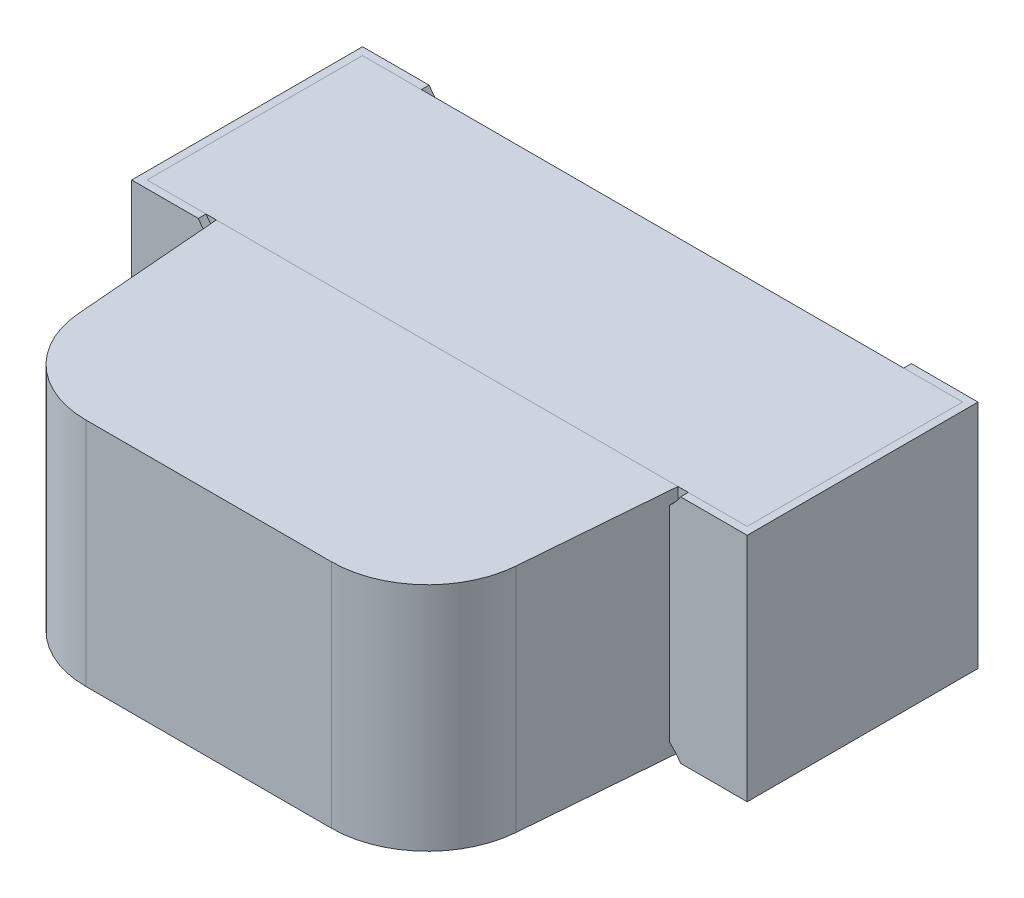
from build123d import *

# Parameters (mm, degrees)
SKETCH1_W        = 1.56
SKETCH1_H        = 0.56
EXTRUDE1_DEPTH   = 0.6
EXTRUDE2_DEPTH   = 0.6
EXTRUDE2_2_DEPTH = 0.6
SKETCH4_R        = 0.15
EXTRUDE4_DEPTH   = 2.166190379
EXTRUDE3_DEPTH   = 0.6
SKETCH5_W        = 0.3
SKETCH5_H        = 0.5
EXTRUDE5_DEPTH   = 0.01


with BuildPart() as part:
    # Sketch1 → Extrude1 (new body)
    with BuildSketch(Plane(origin=(0, 0, 0), x_dir=(1, 0, 0), z_dir=(0, 1, 0))):
        Rectangle(SKETCH1_W, SKETCH1_H)
    extrude(amount=EXTRUDE1_DEPTH)

    # Sketch5 → Extrude5 (cut)
    with BuildSketch(Plane(origin=(0, 0, -0.28), x_dir=(-1, 0, 0), z_dir=(0, 0, -1))):
        with Locations((-0.25, 0.3)):
            Rectangle(SKETCH5_W, SKETCH5_H)
    extrude(amount=-EXTRUDE5_DEPTH, mode=Mode.SUBTRACT)


with BuildPart() as body_2:
    # Sketch2 → Extrude2 (new body)
    with BuildSketch(Plane(origin=(0, 0, 0), x_dir=(1, 0, 0), z_dir=(0, 1, 0))):
        Polygon((0.8, 0.3), (0.55, 0.3), (0.55, 0.28), (0.78, 0.28), (0.78, -0.28), (0.55, -0.28), (0.55, -0.3), (0.8, -0.3), align=None)
    extrude(amount=EXTRUDE2_DEPTH)


with BuildPart() as body_3:
    # Sketch2 → Extrude2 2 (new body)
    with BuildSketch(Plane(origin=(0, 0, 0), x_dir=(1, 0, 0), z_dir=(0, 1, 0))):
        Polygon((-0.8, 0.3), (-0.8, -0.3), (-0.55, -0.3), (-0.55, -0.28), (-0.78, -0.28), (-0.78, 0.28), (-0.55, 0.28), (-0.55, 0.3), align=None)
    extrude(amount=EXTRUDE2_2_DEPTH)


with BuildPart() as extrude4_tool:
    # Sketch4 → Extrude4 (new, through all)
    with BuildSketch(Plane.XY.offset(0.3)):
        with Locations((-0.5, 0.68)):
            Circle(SKETCH4_R)
        with Locations((0.5, 0.68)):
            Circle(SKETCH4_R)
        with Locations((0.5, -0.08)):
            Circle(SKETCH4_R)
        with Locations((-0.5, -0.08)):
            Circle(SKETCH4_R)
    extrude(amount=-EXTRUDE4_DEPTH)


with BuildPart() as body_3_1:
    add(body_3.part)

    # Extrude4: cut by extrude4_tool
    add(extrude4_tool.part, mode=Mode.SUBTRACT)


with BuildPart() as body_2_1:
    add(body_2.part)

    # Extrude4: cut by extrude4_tool
    add(extrude4_tool.part, mode=Mode.SUBTRACT)


with BuildPart() as body_4:
    # Sketch3 → Extrude3 (new body)
    with BuildSketch(Plane(origin=(0, 0, 0), x_dir=(1, 0, 0), z_dir=(0, 1, 0))):
        with BuildLine():
            Line((-0.6, -0.28), (0.6, -0.28))
            Line((0.6, -0.28), (0.568540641, -0.670096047))
            ThreePointArc((0.568540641, -0.670096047), (0.488872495, -0.833744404), (0.319349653, -0.9))
            Line((0.319349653, -0.9), (-0.319349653, -0.9))
            ThreePointArc((-0.319349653, -0.9), (-0.488872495, -0.833744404), (-0.568540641, -0.670096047))
            Line((-0.568540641, -0.670096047), (-0.6, -0.28))
        make_face()
    extrude(amount=EXTRUDE3_DEPTH)


solid = Compound([part.part, body_3_1.part, body_2_1.part, body_4.part])
